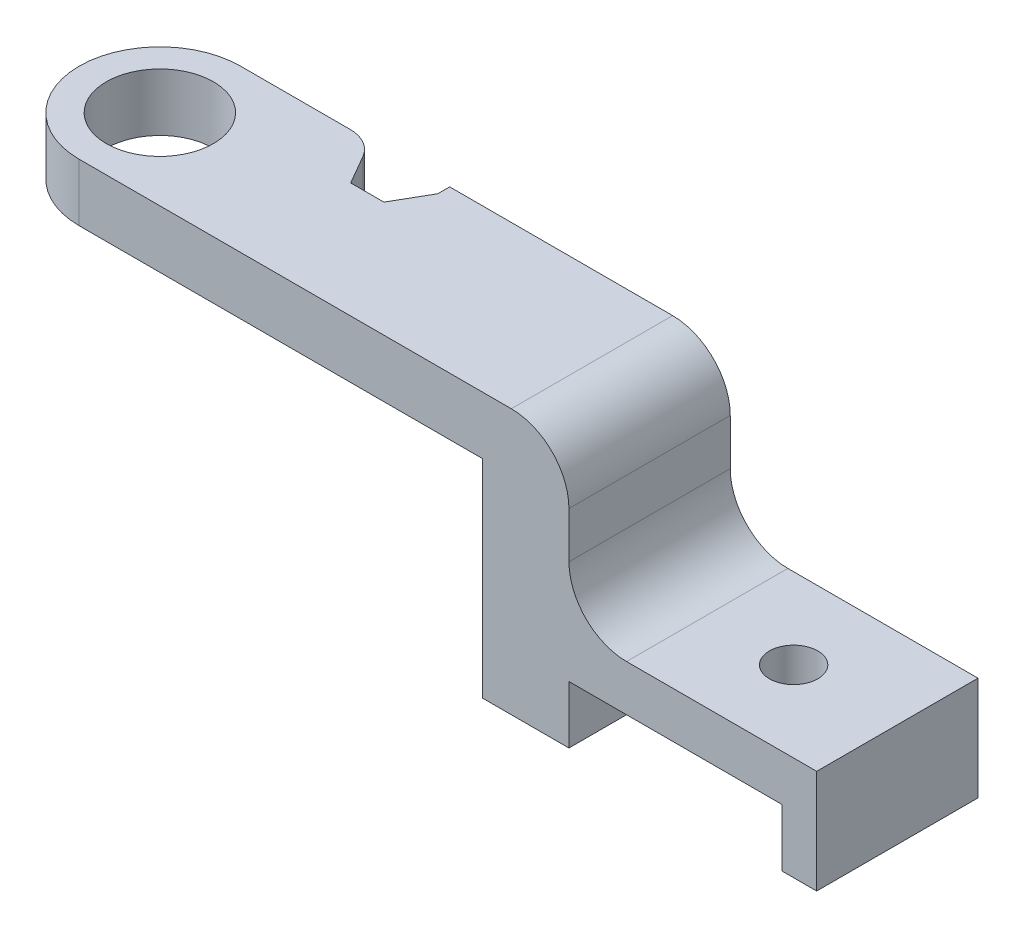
ISO-10303-21;
HEADER;
FILE_DESCRIPTION(('STEP AP214'),'2;1');
FILE_NAME('part.step','',(''),(''),'','','');
FILE_SCHEMA(('AUTOMOTIVE_DESIGN { 1 0 10303 214 1 1 1 1 }'));
ENDSEC;
DATA;
#1=APPLICATION_CONTEXT('core data for automotive mechanical design processes');
#2=APPLICATION_PROTOCOL_DEFINITION('international standard','automotive_design',2000,#1);
#3=PRODUCT_CONTEXT('',#1,'mechanical');
#4=PRODUCT('Part','Part','',(#3));
#5=PRODUCT_RELATED_PRODUCT_CATEGORY('part','',(#4));
#6=PRODUCT_DEFINITION_FORMATION('','',#4);
#7=PRODUCT_DEFINITION_CONTEXT('part definition',#1,'design');
#8=PRODUCT_DEFINITION('design','',#6,#7);
#9=PRODUCT_DEFINITION_SHAPE('','',#8);
#10=(LENGTH_UNIT() NAMED_UNIT(*) SI_UNIT(.MILLI.,.METRE.));
#11=(NAMED_UNIT(*) PLANE_ANGLE_UNIT() SI_UNIT($,.RADIAN.));
#12=(NAMED_UNIT(*) SI_UNIT($,.STERADIAN.) SOLID_ANGLE_UNIT());
#13=UNCERTAINTY_MEASURE_WITH_UNIT(LENGTH_MEASURE(1.E-05),#10,'distance_accuracy_value','');
#14=(GEOMETRIC_REPRESENTATION_CONTEXT(3) GLOBAL_UNCERTAINTY_ASSIGNED_CONTEXT((#13)) GLOBAL_UNIT_ASSIGNED_CONTEXT((#10,
#11,#12)) REPRESENTATION_CONTEXT('',''));
#15=CARTESIAN_POINT('',(0.,0.,0.));
#16=DIRECTION('',(0.,0.,1.));
#17=DIRECTION('',(1.,0.,0.));
#18=AXIS2_PLACEMENT_3D('',#15,#16,#17);
#19=CARTESIAN_POINT('',(0.,0.,0.));
#20=DIRECTION('',(0.,0.,-1.));
#21=DIRECTION('',(-1.,0.,0.));
#22=AXIS2_PLACEMENT_3D('',#19,#20,#21);
#23=PLANE('',#22);
#24=DIRECTION('',(0.,-1.,0.));
#25=VECTOR('',#24,1.);
#26=CARTESIAN_POINT('',(25.15,0.,0.));
#27=LINE('',#26,#25);
#28=CARTESIAN_POINT('',(25.15,5.,0.));
#29=VERTEX_POINT('',#28);
#30=CARTESIAN_POINT('',(25.15,0.,0.));
#31=VERTEX_POINT('',#30);
#32=EDGE_CURVE('E205',#29,#31,#27,.T.);
#33=ORIENTED_EDGE('',*,*,#32,.F.);
#34=DIRECTION('',(-1.,0.,0.));
#35=VECTOR('',#34,1.);
#36=CARTESIAN_POINT('',(0.,5.,0.));
#37=LINE('',#36,#35);
#38=CARTESIAN_POINT('',(44.5,5.,0.));
#39=VERTEX_POINT('',#38);
#40=EDGE_CURVE('E217',#39,#29,#37,.T.);
#41=ORIENTED_EDGE('',*,*,#40,.F.);
#42=CARTESIAN_POINT('',(44.5,0.,0.));
#43=DIRECTION('',(0.,0.,-1.));
#44=DIRECTION('',(-1.,0.,0.));
#45=AXIS2_PLACEMENT_3D('',#42,#43,#44);
#46=CIRCLE('',#45,5.);
#47=CARTESIAN_POINT('',(49.5,0.,0.));
#48=VERTEX_POINT('',#47);
#49=EDGE_CURVE('E276',#39,#48,#46,.T.);
#50=ORIENTED_EDGE('',*,*,#49,.T.);
#51=DIRECTION('',(0.,1.,0.));
#52=VECTOR('',#51,1.);
#53=CARTESIAN_POINT('',(49.5,5.,0.));
#54=LINE('',#53,#52);
#55=CARTESIAN_POINT('',(49.5,-4.,0.));
#56=VERTEX_POINT('',#55);
#57=EDGE_CURVE('E233',#56,#48,#54,.T.);
#58=ORIENTED_EDGE('',*,*,#57,.F.);
#59=CARTESIAN_POINT('',(54.5,-4.,0.));
#60=DIRECTION('',(0.,0.,-1.));
#61=DIRECTION('',(-1.,0.,0.));
#62=AXIS2_PLACEMENT_3D('',#59,#60,#61);
#63=CIRCLE('',#62,5.);
#64=CARTESIAN_POINT('',(54.5,-9.,0.));
#65=VERTEX_POINT('',#64);
#66=EDGE_CURVE('E280',#56,#65,#63,.F.);
#67=ORIENTED_EDGE('',*,*,#66,.T.);
#68=DIRECTION('',(-1.,0.,0.));
#69=VECTOR('',#68,1.);
#70=CARTESIAN_POINT('',(71.,-9.,0.));
#71=LINE('',#70,#69);
#72=CARTESIAN_POINT('',(71.,-9.,0.));
#73=VERTEX_POINT('',#72);
#74=EDGE_CURVE('E368',#73,#65,#71,.T.);
#75=ORIENTED_EDGE('',*,*,#74,.F.);
#76=DIRECTION('',(0.,1.,0.));
#77=VECTOR('',#76,1.);
#78=CARTESIAN_POINT('',(71.,-18.,0.));
#79=LINE('',#78,#77);
#80=CARTESIAN_POINT('',(71.,-18.,0.));
#81=VERTEX_POINT('',#80);
#82=EDGE_CURVE('E367',#81,#73,#79,.T.);
#83=ORIENTED_EDGE('',*,*,#82,.F.);
#84=DIRECTION('',(1.,0.,0.));
#85=VECTOR('',#84,1.);
#86=CARTESIAN_POINT('',(71.,-18.,0.));
#87=LINE('',#86,#85);
#88=CARTESIAN_POINT('',(68.,-18.,0.));
#89=VERTEX_POINT('',#88);
#90=EDGE_CURVE('E365',#89,#81,#87,.T.);
#91=ORIENTED_EDGE('',*,*,#90,.F.);
#92=DIRECTION('',(0.,-1.,0.));
#93=VECTOR('',#92,1.);
#94=CARTESIAN_POINT('',(68.,-18.,0.));
#95=LINE('',#94,#93);
#96=CARTESIAN_POINT('',(68.,-13.,0.));
#97=VERTEX_POINT('',#96);
#98=EDGE_CURVE('E363',#97,#89,#95,.T.);
#99=ORIENTED_EDGE('',*,*,#98,.F.);
#100=DIRECTION('',(1.,0.,0.));
#101=VECTOR('',#100,1.);
#102=CARTESIAN_POINT('',(49.5,-13.,0.));
#103=LINE('',#102,#101);
#104=CARTESIAN_POINT('',(49.5,-13.,0.));
#105=VERTEX_POINT('',#104);
#106=EDGE_CURVE('E361',#105,#97,#103,.T.);
#107=ORIENTED_EDGE('',*,*,#106,.F.);
#108=DIRECTION('',(0.,1.,0.));
#109=VECTOR('',#108,1.);
#110=CARTESIAN_POINT('',(49.5,-18.,0.));
#111=LINE('',#110,#109);
#112=CARTESIAN_POINT('',(49.5,-18.,0.));
#113=VERTEX_POINT('',#112);
#114=EDGE_CURVE('E359',#113,#105,#111,.T.);
#115=ORIENTED_EDGE('',*,*,#114,.F.);
#116=DIRECTION('',(1.,0.,0.));
#117=VECTOR('',#116,1.);
#118=CARTESIAN_POINT('',(42.,-18.,0.));
#119=LINE('',#118,#117);
#120=CARTESIAN_POINT('',(42.,-18.,0.));
#121=VERTEX_POINT('',#120);
#122=EDGE_CURVE('E357',#121,#113,#119,.T.);
#123=ORIENTED_EDGE('',*,*,#122,.F.);
#124=DIRECTION('',(0.,-1.,0.));
#125=VECTOR('',#124,1.);
#126=CARTESIAN_POINT('',(42.,-18.,0.));
#127=LINE('',#126,#125);
#128=CARTESIAN_POINT('',(42.,0.,0.));
#129=VERTEX_POINT('',#128);
#130=EDGE_CURVE('E355',#129,#121,#127,.T.);
#131=ORIENTED_EDGE('',*,*,#130,.F.);
#132=DIRECTION('',(1.,0.,0.));
#133=VECTOR('',#132,1.);
#134=CARTESIAN_POINT('',(42.,0.,0.));
#135=LINE('',#134,#133);
#136=EDGE_CURVE('E219',#31,#129,#135,.T.);
#137=ORIENTED_EDGE('',*,*,#136,.F.);
#138=EDGE_LOOP('',(#33,#41,#50,#58,#67,#75,#83,#91,#99,#107,#115,#123,#131,#137));
#139=FACE_BOUND('',#138,.T.);
#140=ADVANCED_FACE('F67',(#139),#23,.T.);
#141=CARTESIAN_POINT('',(42.,0.,14.));
#142=DIRECTION('',(0.,1.,0.));
#143=DIRECTION('',(-1.,0.,0.));
#144=AXIS2_PLACEMENT_3D('',#141,#142,#143);
#145=PLANE('',#144);
#146=CARTESIAN_POINT('',(7.,0.,7.));
#147=DIRECTION('',(0.,1.,0.));
#148=DIRECTION('',(-1.,0.,0.));
#149=AXIS2_PLACEMENT_3D('',#146,#147,#148);
#150=CIRCLE('',#149,4.65);
#151=CARTESIAN_POINT('',(2.35,0.,7.));
#152=VERTEX_POINT('',#151);
#153=EDGE_CURVE('E319',#152,#152,#150,.T.);
#154=ORIENTED_EDGE('',*,*,#153,.T.);
#155=EDGE_LOOP('',(#154));
#156=FACE_BOUND('',#155,.T.);
#157=CARTESIAN_POINT('',(7.,0.,0.));
#158=VERTEX_POINT('',#157);
#159=CARTESIAN_POINT('',(16.5173938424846,0.,0.));
#160=VERTEX_POINT('',#159);
#161=EDGE_CURVE('E353',#158,#160,#135,.T.);
#162=ORIENTED_EDGE('',*,*,#161,.T.);
#163=CARTESIAN_POINT('',(16.5173938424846,0.,3.));
#164=DIRECTION('',(0.,1.,0.));
#165=DIRECTION('',(-1.,0.,0.));
#166=AXIS2_PLACEMENT_3D('',#163,#164,#165);
#167=CIRCLE('',#166,3.);
#168=CARTESIAN_POINT('',(19.1154700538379,0.,1.49999999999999));
#169=VERTEX_POINT('',#168);
#170=EDGE_CURVE('E12',#160,#169,#167,.F.);
#171=ORIENTED_EDGE('',*,*,#170,.T.);
#172=DIRECTION('',(0.500000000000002,0.,0.866025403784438));
#173=VECTOR('',#172,1.);
#174=CARTESIAN_POINT('',(30.2492613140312,0.,20.784292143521));
#175=LINE('',#174,#173);
#176=CARTESIAN_POINT('',(20.558845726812,0.,4.));
#177=VERTEX_POINT('',#176);
#178=EDGE_CURVE('E291',#169,#177,#175,.T.);
#179=ORIENTED_EDGE('',*,*,#178,.T.);
#180=DIRECTION('',(1.,0.,0.));
#181=VECTOR('',#180,1.);
#182=CARTESIAN_POINT('',(42.,0.,4.));
#183=LINE('',#182,#181);
#184=CARTESIAN_POINT('',(23.441154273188,0.,4.));
#185=VERTEX_POINT('',#184);
#186=EDGE_CURVE('E310',#177,#185,#183,.T.);
#187=ORIENTED_EDGE('',*,*,#186,.T.);
#188=DIRECTION('',(0.500000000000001,0.,-0.866025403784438));
#189=VECTOR('',#188,1.);
#190=CARTESIAN_POINT('',(23.7507386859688,0.,3.46378406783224));
#191=LINE('',#190,#189);
#192=CARTESIAN_POINT('',(25.15,0.,1.04019237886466));
#193=VERTEX_POINT('',#192);
#194=EDGE_CURVE('E313',#185,#193,#191,.T.);
#195=ORIENTED_EDGE('',*,*,#194,.T.);
#196=DIRECTION('',(0.,0.,-1.));
#197=VECTOR('',#196,1.);
#198=CARTESIAN_POINT('',(25.15,0.,14.));
#199=LINE('',#198,#197);
#200=EDGE_CURVE('E308',#193,#31,#199,.T.);
#201=ORIENTED_EDGE('',*,*,#200,.T.);
#202=ORIENTED_EDGE('',*,*,#136,.T.);
#203=DIRECTION('',(0.,0.,-1.));
#204=VECTOR('',#203,1.);
#205=CARTESIAN_POINT('',(42.,0.,14.));
#206=LINE('',#205,#204);
#207=CARTESIAN_POINT('',(42.,0.,14.));
#208=VERTEX_POINT('',#207);
#209=EDGE_CURVE('E259',#208,#129,#206,.T.);
#210=ORIENTED_EDGE('',*,*,#209,.F.);
#211=DIRECTION('',(1.,0.,0.));
#212=VECTOR('',#211,1.);
#213=CARTESIAN_POINT('',(42.,0.,14.));
#214=LINE('',#213,#212);
#215=CARTESIAN_POINT('',(7.,0.,14.));
#216=VERTEX_POINT('',#215);
#217=EDGE_CURVE('E228',#216,#208,#214,.T.);
#218=ORIENTED_EDGE('',*,*,#217,.F.);
#219=CARTESIAN_POINT('',(7.,0.,7.));
#220=DIRECTION('',(0.,1.,0.));
#221=DIRECTION('',(-1.,0.,0.));
#222=AXIS2_PLACEMENT_3D('',#219,#220,#221);
#223=CIRCLE('',#222,7.);
#224=EDGE_CURVE('E325',#158,#216,#223,.T.);
#225=ORIENTED_EDGE('',*,*,#224,.F.);
#226=EDGE_LOOP('',(#162,#171,#179,#187,#195,#201,#202,#210,#218,#225));
#227=FACE_BOUND('',#226,.T.);
#228=ADVANCED_FACE('F394',(#156,#227),#145,.F.);
#229=CARTESIAN_POINT('',(0.,5.,14.));
#230=DIRECTION('',(0.,-1.,0.));
#231=DIRECTION('',(0.,0.,-1.));
#232=AXIS2_PLACEMENT_3D('',#229,#230,#231);
#233=PLANE('',#232);
#234=CARTESIAN_POINT('',(7.,5.,7.));
#235=DIRECTION('',(0.,1.,0.));
#236=DIRECTION('',(0.,0.,1.));
#237=AXIS2_PLACEMENT_3D('',#234,#235,#236);
#238=CIRCLE('',#237,4.65);
#239=CARTESIAN_POINT('',(7.,5.,11.65));
#240=VERTEX_POINT('',#239);
#241=EDGE_CURVE('E316',#240,#240,#238,.T.);
#242=ORIENTED_EDGE('',*,*,#241,.F.);
#243=EDGE_LOOP('',(#242));
#244=FACE_BOUND('',#243,.T.);
#245=DIRECTION('',(0.500000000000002,0.,0.866025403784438));
#246=VECTOR('',#245,1.);
#247=CARTESIAN_POINT('',(18.85,5.,1.04019237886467));
#248=LINE('',#247,#246);
#249=CARTESIAN_POINT('',(19.1154700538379,5.,1.49999999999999));
#250=VERTEX_POINT('',#249);
#251=CARTESIAN_POINT('',(20.558845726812,5.,4.));
#252=VERTEX_POINT('',#251);
#253=EDGE_CURVE('E212',#250,#252,#248,.T.);
#254=ORIENTED_EDGE('',*,*,#253,.F.);
#255=CARTESIAN_POINT('',(16.5173938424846,5.,3.));
#256=DIRECTION('',(0.,-1.,0.));
#257=DIRECTION('',(0.,0.,-1.));
#258=AXIS2_PLACEMENT_3D('',#255,#256,#257);
#259=CIRCLE('',#258,3.);
#260=CARTESIAN_POINT('',(16.5173938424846,5.,0.));
#261=VERTEX_POINT('',#260);
#262=EDGE_CURVE('E89',#250,#261,#259,.F.);
#263=ORIENTED_EDGE('',*,*,#262,.T.);
#264=CARTESIAN_POINT('',(7.,5.,0.));
#265=VERTEX_POINT('',#264);
#266=EDGE_CURVE('E229',#261,#265,#37,.T.);
#267=ORIENTED_EDGE('',*,*,#266,.T.);
#268=CARTESIAN_POINT('',(7.,5.,7.));
#269=DIRECTION('',(0.,1.,0.));
#270=DIRECTION('',(0.,0.,1.));
#271=AXIS2_PLACEMENT_3D('',#268,#269,#270);
#272=CIRCLE('',#271,7.);
#273=CARTESIAN_POINT('',(7.,5.,14.));
#274=VERTEX_POINT('',#273);
#275=EDGE_CURVE('E322',#265,#274,#272,.T.);
#276=ORIENTED_EDGE('',*,*,#275,.T.);
#277=DIRECTION('',(-1.,0.,0.));
#278=VECTOR('',#277,1.);
#279=CARTESIAN_POINT('',(0.,5.,14.));
#280=LINE('',#279,#278);
#281=CARTESIAN_POINT('',(44.5,5.,14.));
#282=VERTEX_POINT('',#281);
#283=EDGE_CURVE('E241',#282,#274,#280,.T.);
#284=ORIENTED_EDGE('',*,*,#283,.F.);
#285=DIRECTION('',(0.,0.,-1.));
#286=VECTOR('',#285,1.);
#287=CARTESIAN_POINT('',(44.5,5.,14.));
#288=LINE('',#287,#286);
#289=EDGE_CURVE('E227',#282,#39,#288,.T.);
#290=ORIENTED_EDGE('',*,*,#289,.T.);
#291=ORIENTED_EDGE('',*,*,#40,.T.);
#292=DIRECTION('',(0.,0.,-1.));
#293=VECTOR('',#292,1.);
#294=CARTESIAN_POINT('',(25.15,5.,1.04019237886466));
#295=LINE('',#294,#293);
#296=CARTESIAN_POINT('',(25.15,5.,1.04019237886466));
#297=VERTEX_POINT('',#296);
#298=EDGE_CURVE('E202',#297,#29,#295,.T.);
#299=ORIENTED_EDGE('',*,*,#298,.F.);
#300=DIRECTION('',(0.500000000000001,0.,-0.866025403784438));
#301=VECTOR('',#300,1.);
#302=CARTESIAN_POINT('',(23.441154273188,5.,4.));
#303=LINE('',#302,#301);
#304=CARTESIAN_POINT('',(23.441154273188,5.,4.));
#305=VERTEX_POINT('',#304);
#306=EDGE_CURVE('E298',#305,#297,#303,.T.);
#307=ORIENTED_EDGE('',*,*,#306,.F.);
#308=DIRECTION('',(1.,0.,0.));
#309=VECTOR('',#308,1.);
#310=CARTESIAN_POINT('',(23.441154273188,5.,4.));
#311=LINE('',#310,#309);
#312=EDGE_CURVE('E296',#252,#305,#311,.T.);
#313=ORIENTED_EDGE('',*,*,#312,.F.);
#314=EDGE_LOOP('',(#254,#263,#267,#276,#284,#290,#291,#299,#307,#313));
#315=FACE_BOUND('',#314,.T.);
#316=ADVANCED_FACE('F224',(#244,#315),#233,.F.);
#317=CARTESIAN_POINT('',(0.,0.,14.));
#318=DIRECTION('',(0.,0.,-1.));
#319=DIRECTION('',(-1.,0.,0.));
#320=AXIS2_PLACEMENT_3D('',#317,#318,#319);
#321=PLANE('',#320);
#322=DIRECTION('',(0.,1.,0.));
#323=VECTOR('',#322,1.);
#324=CARTESIAN_POINT('',(49.5,5.,14.));
#325=LINE('',#324,#323);
#326=CARTESIAN_POINT('',(49.5,-4.,14.));
#327=VERTEX_POINT('',#326);
#328=CARTESIAN_POINT('',(49.5,0.,14.));
#329=VERTEX_POINT('',#328);
#330=EDGE_CURVE('E349',#327,#329,#325,.T.);
#331=ORIENTED_EDGE('',*,*,#330,.T.);
#332=CARTESIAN_POINT('',(44.5,0.,14.));
#333=DIRECTION('',(0.,0.,-1.));
#334=DIRECTION('',(-1.,0.,0.));
#335=AXIS2_PLACEMENT_3D('',#332,#333,#334);
#336=CIRCLE('',#335,5.);
#337=EDGE_CURVE('E278',#329,#282,#336,.F.);
#338=ORIENTED_EDGE('',*,*,#337,.T.);
#339=ORIENTED_EDGE('',*,*,#283,.T.);
#340=DIRECTION('',(0.,1.,0.));
#341=VECTOR('',#340,1.);
#342=CARTESIAN_POINT('',(7.,-3.,14.));
#343=LINE('',#342,#341);
#344=EDGE_CURVE('E265',#216,#274,#343,.T.);
#345=ORIENTED_EDGE('',*,*,#344,.F.);
#346=ORIENTED_EDGE('',*,*,#217,.T.);
#347=DIRECTION('',(0.,-1.,0.));
#348=VECTOR('',#347,1.);
#349=CARTESIAN_POINT('',(42.,-18.,14.));
#350=LINE('',#349,#348);
#351=CARTESIAN_POINT('',(42.,-18.,14.));
#352=VERTEX_POINT('',#351);
#353=EDGE_CURVE('E231',#208,#352,#350,.T.);
#354=ORIENTED_EDGE('',*,*,#353,.T.);
#355=DIRECTION('',(1.,0.,0.));
#356=VECTOR('',#355,1.);
#357=CARTESIAN_POINT('',(42.,-18.,14.));
#358=LINE('',#357,#356);
#359=CARTESIAN_POINT('',(49.5,-18.,14.));
#360=VERTEX_POINT('',#359);
#361=EDGE_CURVE('E334',#352,#360,#358,.T.);
#362=ORIENTED_EDGE('',*,*,#361,.T.);
#363=DIRECTION('',(0.,1.,0.));
#364=VECTOR('',#363,1.);
#365=CARTESIAN_POINT('',(49.5,-18.,14.));
#366=LINE('',#365,#364);
#367=CARTESIAN_POINT('',(49.5,-13.,14.));
#368=VERTEX_POINT('',#367);
#369=EDGE_CURVE('E336',#360,#368,#366,.T.);
#370=ORIENTED_EDGE('',*,*,#369,.T.);
#371=DIRECTION('',(1.,0.,0.));
#372=VECTOR('',#371,1.);
#373=CARTESIAN_POINT('',(49.5,-13.,14.));
#374=LINE('',#373,#372);
#375=CARTESIAN_POINT('',(68.,-13.,14.));
#376=VERTEX_POINT('',#375);
#377=EDGE_CURVE('E338',#368,#376,#374,.T.);
#378=ORIENTED_EDGE('',*,*,#377,.T.);
#379=DIRECTION('',(0.,-1.,0.));
#380=VECTOR('',#379,1.);
#381=CARTESIAN_POINT('',(68.,-18.,14.));
#382=LINE('',#381,#380);
#383=CARTESIAN_POINT('',(68.,-18.,14.));
#384=VERTEX_POINT('',#383);
#385=EDGE_CURVE('E340',#376,#384,#382,.T.);
#386=ORIENTED_EDGE('',*,*,#385,.T.);
#387=DIRECTION('',(1.,0.,0.));
#388=VECTOR('',#387,1.);
#389=CARTESIAN_POINT('',(71.,-18.,14.));
#390=LINE('',#389,#388);
#391=CARTESIAN_POINT('',(71.,-18.,14.));
#392=VERTEX_POINT('',#391);
#393=EDGE_CURVE('E342',#384,#392,#390,.T.);
#394=ORIENTED_EDGE('',*,*,#393,.T.);
#395=DIRECTION('',(0.,1.,0.));
#396=VECTOR('',#395,1.);
#397=CARTESIAN_POINT('',(71.,-18.,14.));
#398=LINE('',#397,#396);
#399=CARTESIAN_POINT('',(71.,-9.,14.));
#400=VERTEX_POINT('',#399);
#401=EDGE_CURVE('E344',#392,#400,#398,.T.);
#402=ORIENTED_EDGE('',*,*,#401,.T.);
#403=DIRECTION('',(-1.,0.,0.));
#404=VECTOR('',#403,1.);
#405=CARTESIAN_POINT('',(71.,-9.,14.));
#406=LINE('',#405,#404);
#407=CARTESIAN_POINT('',(54.5,-9.,14.));
#408=VERTEX_POINT('',#407);
#409=EDGE_CURVE('E346',#400,#408,#406,.T.);
#410=ORIENTED_EDGE('',*,*,#409,.T.);
#411=CARTESIAN_POINT('',(54.5,-4.,14.));
#412=DIRECTION('',(0.,0.,-1.));
#413=DIRECTION('',(-1.,0.,0.));
#414=AXIS2_PLACEMENT_3D('',#411,#412,#413);
#415=CIRCLE('',#414,5.);
#416=EDGE_CURVE('E221',#408,#327,#415,.T.);
#417=ORIENTED_EDGE('',*,*,#416,.T.);
#418=EDGE_LOOP('',(#331,#338,#339,#345,#346,#354,#362,#370,#378,#386,#394,#402,#410,#417));
#419=FACE_BOUND('',#418,.T.);
#420=ADVANCED_FACE('F384',(#419),#321,.F.);
#421=ORIENTED_EDGE('',*,*,#266,.F.);
#422=DIRECTION('',(0.,1.,0.));
#423=VECTOR('',#422,1.);
#424=CARTESIAN_POINT('',(16.5173938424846,0.,0.));
#425=LINE('',#424,#423);
#426=EDGE_CURVE('E75',#261,#160,#425,.F.);
#427=ORIENTED_EDGE('',*,*,#426,.T.);
#428=ORIENTED_EDGE('',*,*,#161,.F.);
#429=DIRECTION('',(0.,1.,0.));
#430=VECTOR('',#429,1.);
#431=CARTESIAN_POINT('',(7.,-3.,0.));
#432=LINE('',#431,#430);
#433=EDGE_CURVE('E262',#158,#265,#432,.T.);
#434=ORIENTED_EDGE('',*,*,#433,.T.);
#435=EDGE_LOOP('',(#421,#427,#428,#434));
#436=FACE_BOUND('',#435,.T.);
#437=ADVANCED_FACE('F447',(#436),#23,.T.);
#438=CARTESIAN_POINT('',(42.,-18.,14.));
#439=DIRECTION('',(1.,0.,0.));
#440=DIRECTION('',(0.,0.,-1.));
#441=AXIS2_PLACEMENT_3D('',#438,#439,#440);
#442=PLANE('',#441);
#443=ORIENTED_EDGE('',*,*,#130,.T.);
#444=DIRECTION('',(0.,0.,-1.));
#445=VECTOR('',#444,1.);
#446=CARTESIAN_POINT('',(42.,-18.,14.));
#447=LINE('',#446,#445);
#448=EDGE_CURVE('E256',#352,#121,#447,.T.);
#449=ORIENTED_EDGE('',*,*,#448,.F.);
#450=ORIENTED_EDGE('',*,*,#353,.F.);
#451=ORIENTED_EDGE('',*,*,#209,.T.);
#452=EDGE_LOOP('',(#443,#449,#450,#451));
#453=FACE_BOUND('',#452,.T.);
#454=ADVANCED_FACE('F396',(#453),#442,.F.);
#455=CARTESIAN_POINT('',(42.,-18.,14.));
#456=DIRECTION('',(0.,1.,0.));
#457=DIRECTION('',(0.,0.,1.));
#458=AXIS2_PLACEMENT_3D('',#455,#456,#457);
#459=PLANE('',#458);
#460=ORIENTED_EDGE('',*,*,#122,.T.);
#461=DIRECTION('',(0.,0.,-1.));
#462=VECTOR('',#461,1.);
#463=CARTESIAN_POINT('',(49.5,-18.,14.));
#464=LINE('',#463,#462);
#465=EDGE_CURVE('E253',#360,#113,#464,.T.);
#466=ORIENTED_EDGE('',*,*,#465,.F.);
#467=ORIENTED_EDGE('',*,*,#361,.F.);
#468=ORIENTED_EDGE('',*,*,#448,.T.);
#469=EDGE_LOOP('',(#460,#466,#467,#468));
#470=FACE_BOUND('',#469,.T.);
#471=ADVANCED_FACE('F403',(#470),#459,.F.);
#472=CARTESIAN_POINT('',(49.5,-18.,14.));
#473=DIRECTION('',(-1.,0.,0.));
#474=DIRECTION('',(0.,-1.,0.));
#475=AXIS2_PLACEMENT_3D('',#472,#473,#474);
#476=PLANE('',#475);
#477=ORIENTED_EDGE('',*,*,#114,.T.);
#478=DIRECTION('',(0.,0.,-1.));
#479=VECTOR('',#478,1.);
#480=CARTESIAN_POINT('',(49.5,-13.,14.));
#481=LINE('',#480,#479);
#482=EDGE_CURVE('E250',#368,#105,#481,.T.);
#483=ORIENTED_EDGE('',*,*,#482,.F.);
#484=ORIENTED_EDGE('',*,*,#369,.F.);
#485=ORIENTED_EDGE('',*,*,#465,.T.);
#486=EDGE_LOOP('',(#477,#483,#484,#485));
#487=FACE_BOUND('',#486,.T.);
#488=ADVANCED_FACE('F407',(#487),#476,.F.);
#489=CARTESIAN_POINT('',(49.5,-13.,14.));
#490=DIRECTION('',(0.,1.,0.));
#491=DIRECTION('',(0.,0.,1.));
#492=AXIS2_PLACEMENT_3D('',#489,#490,#491);
#493=PLANE('',#492);
#494=CARTESIAN_POINT('',(62.,-13.,7.));
#495=DIRECTION('',(0.,1.,0.));
#496=DIRECTION('',(0.,0.,1.));
#497=AXIS2_PLACEMENT_3D('',#494,#495,#496);
#498=CIRCLE('',#497,2.10000000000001);
#499=CARTESIAN_POINT('',(62.,-13.,9.10000000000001));
#500=VERTEX_POINT('',#499);
#501=EDGE_CURVE('E330',#500,#500,#498,.T.);
#502=ORIENTED_EDGE('',*,*,#501,.T.);
#503=EDGE_LOOP('',(#502));
#504=FACE_BOUND('',#503,.T.);
#505=ORIENTED_EDGE('',*,*,#106,.T.);
#506=DIRECTION('',(0.,0.,-1.));
#507=VECTOR('',#506,1.);
#508=CARTESIAN_POINT('',(68.,-13.,14.));
#509=LINE('',#508,#507);
#510=EDGE_CURVE('E247',#376,#97,#509,.T.);
#511=ORIENTED_EDGE('',*,*,#510,.F.);
#512=ORIENTED_EDGE('',*,*,#377,.F.);
#513=ORIENTED_EDGE('',*,*,#482,.T.);
#514=EDGE_LOOP('',(#505,#511,#512,#513));
#515=FACE_BOUND('',#514,.T.);
#516=ADVANCED_FACE('F412',(#504,#515),#493,.F.);
#517=CARTESIAN_POINT('',(68.,-18.,14.));
#518=DIRECTION('',(1.,0.,0.));
#519=DIRECTION('',(0.,0.,-1.));
#520=AXIS2_PLACEMENT_3D('',#517,#518,#519);
#521=PLANE('',#520);
#522=ORIENTED_EDGE('',*,*,#98,.T.);
#523=DIRECTION('',(0.,0.,-1.));
#524=VECTOR('',#523,1.);
#525=CARTESIAN_POINT('',(68.,-18.,14.));
#526=LINE('',#525,#524);
#527=EDGE_CURVE('E244',#384,#89,#526,.T.);
#528=ORIENTED_EDGE('',*,*,#527,.F.);
#529=ORIENTED_EDGE('',*,*,#385,.F.);
#530=ORIENTED_EDGE('',*,*,#510,.T.);
#531=EDGE_LOOP('',(#522,#528,#529,#530));
#532=FACE_BOUND('',#531,.T.);
#533=ADVANCED_FACE('F418',(#532),#521,.F.);
#534=CARTESIAN_POINT('',(71.,-18.,14.));
#535=DIRECTION('',(0.,1.,0.));
#536=DIRECTION('',(0.,0.,1.));
#537=AXIS2_PLACEMENT_3D('',#534,#535,#536);
#538=PLANE('',#537);
#539=ORIENTED_EDGE('',*,*,#90,.T.);
#540=DIRECTION('',(0.,0.,-1.));
#541=VECTOR('',#540,1.);
#542=CARTESIAN_POINT('',(71.,-18.,14.));
#543=LINE('',#542,#541);
#544=EDGE_CURVE('E240',#392,#81,#543,.T.);
#545=ORIENTED_EDGE('',*,*,#544,.F.);
#546=ORIENTED_EDGE('',*,*,#393,.F.);
#547=ORIENTED_EDGE('',*,*,#527,.T.);
#548=EDGE_LOOP('',(#539,#545,#546,#547));
#549=FACE_BOUND('',#548,.T.);
#550=ADVANCED_FACE('F422',(#549),#538,.F.);
#551=CARTESIAN_POINT('',(71.,-18.,14.));
#552=DIRECTION('',(-1.,0.,0.));
#553=DIRECTION('',(0.,0.,1.));
#554=AXIS2_PLACEMENT_3D('',#551,#552,#553);
#555=PLANE('',#554);
#556=ORIENTED_EDGE('',*,*,#82,.T.);
#557=DIRECTION('',(0.,0.,-1.));
#558=VECTOR('',#557,1.);
#559=CARTESIAN_POINT('',(71.,-9.,14.));
#560=LINE('',#559,#558);
#561=EDGE_CURVE('E237',#400,#73,#560,.T.);
#562=ORIENTED_EDGE('',*,*,#561,.F.);
#563=ORIENTED_EDGE('',*,*,#401,.F.);
#564=ORIENTED_EDGE('',*,*,#544,.T.);
#565=EDGE_LOOP('',(#556,#562,#563,#564));
#566=FACE_BOUND('',#565,.T.);
#567=ADVANCED_FACE('F427',(#566),#555,.F.);
#568=CARTESIAN_POINT('',(71.,-9.,14.));
#569=DIRECTION('',(0.,-1.,0.));
#570=DIRECTION('',(1.,0.,0.));
#571=AXIS2_PLACEMENT_3D('',#568,#569,#570);
#572=PLANE('',#571);
#573=CARTESIAN_POINT('',(62.,-9.00000000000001,7.));
#574=DIRECTION('',(0.,1.,0.));
#575=DIRECTION('',(0.,0.,1.));
#576=AXIS2_PLACEMENT_3D('',#573,#574,#575);
#577=CIRCLE('',#576,2.10000000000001);
#578=CARTESIAN_POINT('',(62.,-9.00000000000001,9.10000000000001));
#579=VERTEX_POINT('',#578);
#580=EDGE_CURVE('E327',#579,#579,#577,.T.);
#581=ORIENTED_EDGE('',*,*,#580,.F.);
#582=EDGE_LOOP('',(#581));
#583=FACE_BOUND('',#582,.T.);
#584=ORIENTED_EDGE('',*,*,#74,.T.);
#585=DIRECTION('',(0.,0.,-1.));
#586=VECTOR('',#585,1.);
#587=CARTESIAN_POINT('',(54.5,-9.,14.));
#588=LINE('',#587,#586);
#589=EDGE_CURVE('E273',#65,#408,#588,.F.);
#590=ORIENTED_EDGE('',*,*,#589,.T.);
#591=ORIENTED_EDGE('',*,*,#409,.F.);
#592=ORIENTED_EDGE('',*,*,#561,.T.);
#593=EDGE_LOOP('',(#584,#590,#591,#592));
#594=FACE_BOUND('',#593,.T.);
#595=ADVANCED_FACE('F432',(#583,#594),#572,.F.);
#596=CARTESIAN_POINT('',(49.5,5.,14.));
#597=DIRECTION('',(-1.,0.,0.));
#598=DIRECTION('',(0.,0.,1.));
#599=AXIS2_PLACEMENT_3D('',#596,#597,#598);
#600=PLANE('',#599);
#601=ORIENTED_EDGE('',*,*,#330,.F.);
#602=DIRECTION('',(0.,0.,-1.));
#603=VECTOR('',#602,1.);
#604=CARTESIAN_POINT('',(49.5,-4.,0.));
#605=LINE('',#604,#603);
#606=EDGE_CURVE('E270',#327,#56,#605,.T.);
#607=ORIENTED_EDGE('',*,*,#606,.T.);
#608=ORIENTED_EDGE('',*,*,#57,.T.);
#609=DIRECTION('',(0.,0.,-1.));
#610=VECTOR('',#609,1.);
#611=CARTESIAN_POINT('',(49.5,0.,14.));
#612=LINE('',#611,#610);
#613=EDGE_CURVE('E268',#48,#329,#612,.F.);
#614=ORIENTED_EDGE('',*,*,#613,.T.);
#615=EDGE_LOOP('',(#601,#607,#608,#614));
#616=FACE_BOUND('',#615,.T.);
#617=ADVANCED_FACE('F378',(#616),#600,.F.);
#618=CARTESIAN_POINT('',(62.,-17.,7.));
#619=DIRECTION('',(0.,1.,0.));
#620=DIRECTION('',(0.,0.,1.));
#621=AXIS2_PLACEMENT_3D('',#618,#619,#620);
#622=CYLINDRICAL_SURFACE('',#621,2.10000000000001);
#623=ORIENTED_EDGE('',*,*,#580,.T.);
#624=EDGE_LOOP('',(#623));
#625=FACE_BOUND('',#624,.T.);
#626=ORIENTED_EDGE('',*,*,#501,.F.);
#627=EDGE_LOOP('',(#626));
#628=FACE_BOUND('',#627,.T.);
#629=ADVANCED_FACE('F440',(#625,#628),#622,.F.);
#630=CARTESIAN_POINT('',(7.,-3.,7.));
#631=DIRECTION('',(0.,1.,0.));
#632=DIRECTION('',(0.,0.,1.));
#633=AXIS2_PLACEMENT_3D('',#630,#631,#632);
#634=CYLINDRICAL_SURFACE('',#633,7.);
#635=ORIENTED_EDGE('',*,*,#224,.T.);
#636=ORIENTED_EDGE('',*,*,#344,.T.);
#637=ORIENTED_EDGE('',*,*,#275,.F.);
#638=ORIENTED_EDGE('',*,*,#433,.F.);
#639=EDGE_LOOP('',(#635,#636,#637,#638));
#640=FACE_BOUND('',#639,.T.);
#641=ADVANCED_FACE('F388',(#640),#634,.T.);
#642=CARTESIAN_POINT('',(7.,-3.,7.));
#643=DIRECTION('',(0.,1.,0.));
#644=DIRECTION('',(0.,0.,1.));
#645=AXIS2_PLACEMENT_3D('',#642,#643,#644);
#646=CYLINDRICAL_SURFACE('',#645,4.65);
#647=ORIENTED_EDGE('',*,*,#241,.T.);
#648=EDGE_LOOP('',(#647));
#649=FACE_BOUND('',#648,.T.);
#650=ORIENTED_EDGE('',*,*,#153,.F.);
#651=EDGE_LOOP('',(#650));
#652=FACE_BOUND('',#651,.T.);
#653=ADVANCED_FACE('F479',(#649,#652),#646,.F.);
#654=CARTESIAN_POINT('',(54.5,-4.,14.));
#655=DIRECTION('',(0.,0.,1.));
#656=DIRECTION('',(1.,0.,0.));
#657=AXIS2_PLACEMENT_3D('',#654,#655,#656);
#658=CYLINDRICAL_SURFACE('',#657,5.);
#659=ORIENTED_EDGE('',*,*,#416,.F.);
#660=ORIENTED_EDGE('',*,*,#589,.F.);
#661=ORIENTED_EDGE('',*,*,#66,.F.);
#662=ORIENTED_EDGE('',*,*,#606,.F.);
#663=EDGE_LOOP('',(#659,#660,#661,#662));
#664=FACE_BOUND('',#663,.T.);
#665=ADVANCED_FACE('F431',(#664),#658,.F.);
#666=CARTESIAN_POINT('',(44.5,0.,14.));
#667=DIRECTION('',(0.,0.,-1.));
#668=DIRECTION('',(-1.,0.,0.));
#669=AXIS2_PLACEMENT_3D('',#666,#667,#668);
#670=CYLINDRICAL_SURFACE('',#669,5.);
#671=ORIENTED_EDGE('',*,*,#337,.F.);
#672=ORIENTED_EDGE('',*,*,#613,.F.);
#673=ORIENTED_EDGE('',*,*,#49,.F.);
#674=ORIENTED_EDGE('',*,*,#289,.F.);
#675=EDGE_LOOP('',(#671,#672,#673,#674));
#676=FACE_BOUND('',#675,.T.);
#677=ADVANCED_FACE('F382',(#676),#670,.T.);
#678=CARTESIAN_POINT('',(23.441154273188,-5.,4.));
#679=DIRECTION('',(0.866025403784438,0.,0.500000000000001));
#680=DIRECTION('',(0.500000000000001,0.,-0.866025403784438));
#681=AXIS2_PLACEMENT_3D('',#678,#679,#680);
#682=PLANE('',#681);
#683=DIRECTION('',(0.,1.,0.));
#684=VECTOR('',#683,1.);
#685=CARTESIAN_POINT('',(23.441154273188,-5.,4.));
#686=LINE('',#685,#684);
#687=EDGE_CURVE('E304',#185,#305,#686,.T.);
#688=ORIENTED_EDGE('',*,*,#687,.T.);
#689=ORIENTED_EDGE('',*,*,#306,.T.);
#690=DIRECTION('',(0.,1.,0.));
#691=VECTOR('',#690,1.);
#692=CARTESIAN_POINT('',(25.15,-5.,1.04019237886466));
#693=LINE('',#692,#691);
#694=EDGE_CURVE('E208',#193,#297,#693,.T.);
#695=ORIENTED_EDGE('',*,*,#694,.F.);
#696=ORIENTED_EDGE('',*,*,#194,.F.);
#697=EDGE_LOOP('',(#688,#689,#695,#696));
#698=FACE_BOUND('',#697,.T.);
#699=ADVANCED_FACE('F469',(#698),#682,.F.);
#700=CARTESIAN_POINT('',(23.441154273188,-5.,4.));
#701=DIRECTION('',(0.,0.,1.));
#702=DIRECTION('',(1.,0.,0.));
#703=AXIS2_PLACEMENT_3D('',#700,#701,#702);
#704=PLANE('',#703);
#705=DIRECTION('',(0.,1.,0.));
#706=VECTOR('',#705,1.);
#707=CARTESIAN_POINT('',(20.558845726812,-5.,4.));
#708=LINE('',#707,#706);
#709=EDGE_CURVE('E302',#177,#252,#708,.T.);
#710=ORIENTED_EDGE('',*,*,#709,.T.);
#711=ORIENTED_EDGE('',*,*,#312,.T.);
#712=ORIENTED_EDGE('',*,*,#687,.F.);
#713=ORIENTED_EDGE('',*,*,#186,.F.);
#714=EDGE_LOOP('',(#710,#711,#712,#713));
#715=FACE_BOUND('',#714,.T.);
#716=ADVANCED_FACE('F467',(#715),#704,.F.);
#717=CARTESIAN_POINT('',(25.15,-5.,1.04019237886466));
#718=DIRECTION('',(1.,0.,0.));
#719=DIRECTION('',(0.,0.,-1.));
#720=AXIS2_PLACEMENT_3D('',#717,#718,#719);
#721=PLANE('',#720);
#722=ORIENTED_EDGE('',*,*,#694,.T.);
#723=ORIENTED_EDGE('',*,*,#298,.T.);
#724=ORIENTED_EDGE('',*,*,#32,.T.);
#725=ORIENTED_EDGE('',*,*,#200,.F.);
#726=EDGE_LOOP('',(#722,#723,#724,#725));
#727=FACE_BOUND('',#726,.T.);
#728=ADVANCED_FACE('F204',(#727),#721,.F.);
#729=CARTESIAN_POINT('',(18.85,-5.,1.04019237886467));
#730=DIRECTION('',(-0.866025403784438,0.,0.500000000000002));
#731=DIRECTION('',(0.500000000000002,0.,0.866025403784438));
#732=AXIS2_PLACEMENT_3D('',#729,#730,#731);
#733=PLANE('',#732);
#734=ORIENTED_EDGE('',*,*,#178,.F.);
#735=DIRECTION('',(0.,1.,0.));
#736=VECTOR('',#735,1.);
#737=CARTESIAN_POINT('',(19.1154700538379,5.,1.49999999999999));
#738=LINE('',#737,#736);
#739=EDGE_CURVE('E220',#169,#250,#738,.T.);
#740=ORIENTED_EDGE('',*,*,#739,.T.);
#741=ORIENTED_EDGE('',*,*,#253,.T.);
#742=ORIENTED_EDGE('',*,*,#709,.F.);
#743=EDGE_LOOP('',(#734,#740,#741,#742));
#744=FACE_BOUND('',#743,.T.);
#745=ADVANCED_FACE('F288',(#744),#733,.F.);
#746=CARTESIAN_POINT('',(16.5173938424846,-5.,3.));
#747=DIRECTION('',(0.,-1.,0.));
#748=DIRECTION('',(0.,0.,-1.));
#749=AXIS2_PLACEMENT_3D('',#746,#747,#748);
#750=CYLINDRICAL_SURFACE('',#749,3.);
#751=ORIENTED_EDGE('',*,*,#170,.F.);
#752=ORIENTED_EDGE('',*,*,#426,.F.);
#753=ORIENTED_EDGE('',*,*,#262,.F.);
#754=ORIENTED_EDGE('',*,*,#739,.F.);
#755=EDGE_LOOP('',(#751,#752,#753,#754));
#756=FACE_BOUND('',#755,.T.);
#757=ADVANCED_FACE('F69',(#756),#750,.T.);
#758=CLOSED_SHELL('',(#140,#228,#316,#420,#437,#454,#471,#488,#516,#533,#550,#567,#595,#617,
#629,#641,#653,#665,#677,#699,#716,#728,#745,#757));
#759=MANIFOLD_SOLID_BREP('B2',#758);
#760=ADVANCED_BREP_SHAPE_REPRESENTATION('',(#18,#759),#14);
#761=SHAPE_DEFINITION_REPRESENTATION(#9,#760);
ENDSEC;
END-ISO-10303-21;
